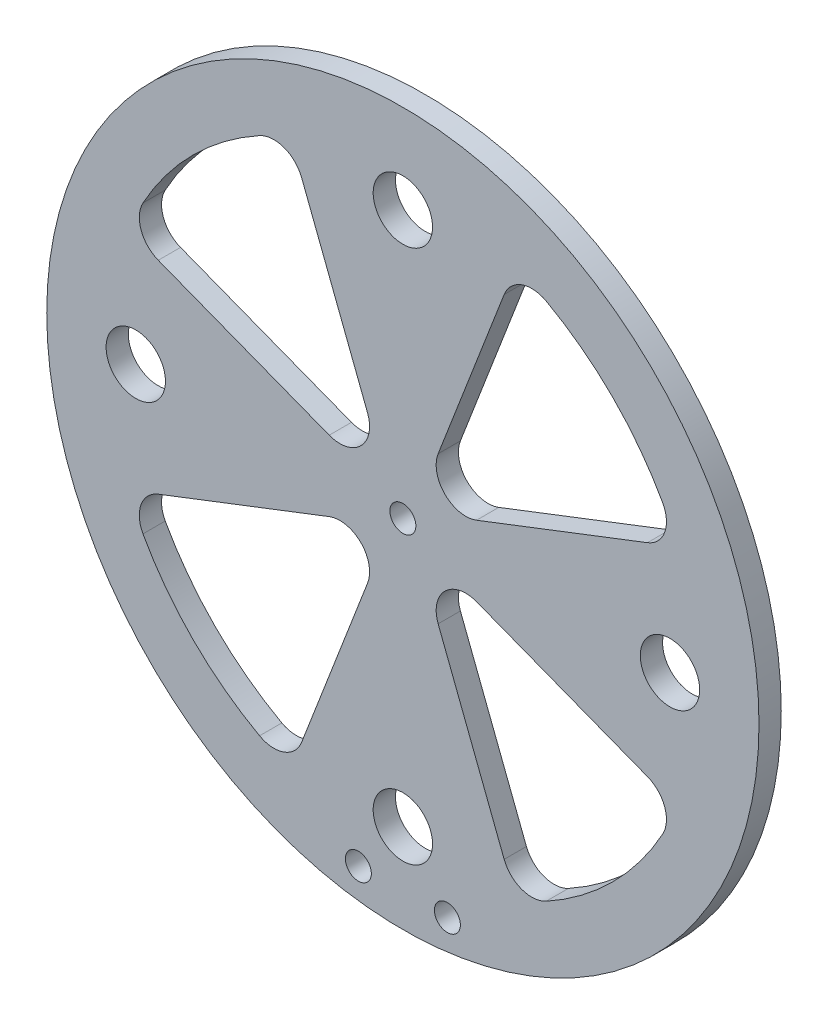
from build123d import *

# Parameters (mm, degrees)
SKETCH1_R      = 48
SKETCH1_R_2    = 4
SKETCH1_R_3    = 1.75
EXTRUDE1_DEPTH = 3


with BuildPart() as part:
    # Sketch1 → Extrude1 (new body)
    with BuildSketch(Plane.XY):
        Circle(SKETCH1_R)
        with Locations((0, 36)):
            Circle(SKETCH1_R_2, mode=Mode.SUBTRACT)
        with Locations((36, 0)):
            Circle(SKETCH1_R_2, mode=Mode.SUBTRACT)
        with Locations((0, -36)):
            Circle(SKETCH1_R_2, mode=Mode.SUBTRACT)
        with Locations((-36, 0)):
            Circle(SKETCH1_R_2, mode=Mode.SUBTRACT)
        Circle(SKETCH1_R_3, mode=Mode.SUBTRACT)
        with Locations((6, -43.588989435)):
            Circle(SKETCH1_R_3, mode=Mode.SUBTRACT)
        with Locations((-6, -43.588989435)):
            Circle(SKETCH1_R_3, mode=Mode.SUBTRACT)
        with BuildLine():
            Line((4.753867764, 9.926306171), (13.651557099, 32.96613113))
            ThreePointArc((13.651557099, 32.96613113), (16.014506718, 35.283737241), (19.314411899, 35.027895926))
            ThreePointArc((19.314411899, 35.027895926), (28.284271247, 28.284271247), (35.027895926, 19.314411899))
            ThreePointArc((35.027895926, 19.314411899), (35.283737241, 16.014506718), (32.96613113, 13.651557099))
            Line((32.96613113, 13.651557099), (9.926306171, 4.753867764))
            ThreePointArc((9.926306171, 4.753867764), (5.656854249, 5.656854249), (4.753867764, 9.926306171))
        make_face(mode=Mode.SUBTRACT)
        with BuildLine():
            Line((-4.753867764, 9.926306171), (-13.651557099, 32.96613113))
            ThreePointArc((-13.651557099, 32.96613113), (-16.014506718, 35.283737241), (-19.314411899, 35.027895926))
            ThreePointArc((-19.314411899, 35.027895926), (-28.284271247, 28.284271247), (-35.027895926, 19.314411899))
            ThreePointArc((-35.027895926, 19.314411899), (-35.283737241, 16.014506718), (-32.96613113, 13.651557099))
            Line((-32.96613113, 13.651557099), (-9.926306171, 4.753867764))
            ThreePointArc((-9.926306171, 4.753867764), (-5.656854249, 5.656854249), (-4.753867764, 9.926306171))
        make_face(mode=Mode.SUBTRACT)
        with BuildLine():
            Line((-9.926306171, -4.753867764), (-32.96613113, -13.651557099))
            ThreePointArc((-32.96613113, -13.651557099), (-35.283737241, -16.014506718), (-35.027895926, -19.314411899))
            ThreePointArc((-35.027895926, -19.314411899), (-28.284271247, -28.284271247), (-19.314411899, -35.027895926))
            ThreePointArc((-19.314411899, -35.027895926), (-16.014506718, -35.283737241), (-13.651557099, -32.96613113))
            Line((-13.651557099, -32.96613113), (-4.753867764, -9.926306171))
            ThreePointArc((-4.753867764, -9.926306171), (-5.656854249, -5.656854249), (-9.926306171, -4.753867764))
        make_face(mode=Mode.SUBTRACT)
        with BuildLine():
            Line((4.753867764, -9.926306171), (13.651557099, -32.96613113))
            ThreePointArc((13.651557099, -32.96613113), (16.014506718, -35.283737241), (19.314411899, -35.027895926))
            ThreePointArc((19.314411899, -35.027895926), (28.284271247, -28.284271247), (35.027895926, -19.314411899))
            ThreePointArc((35.027895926, -19.314411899), (35.283737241, -16.014506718), (32.96613113, -13.651557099))
            Line((32.96613113, -13.651557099), (9.926306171, -4.753867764))
            ThreePointArc((9.926306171, -4.753867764), (5.656854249, -5.656854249), (4.753867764, -9.926306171))
        make_face(mode=Mode.SUBTRACT)
    extrude(amount=EXTRUDE1_DEPTH)


solid = part.part
